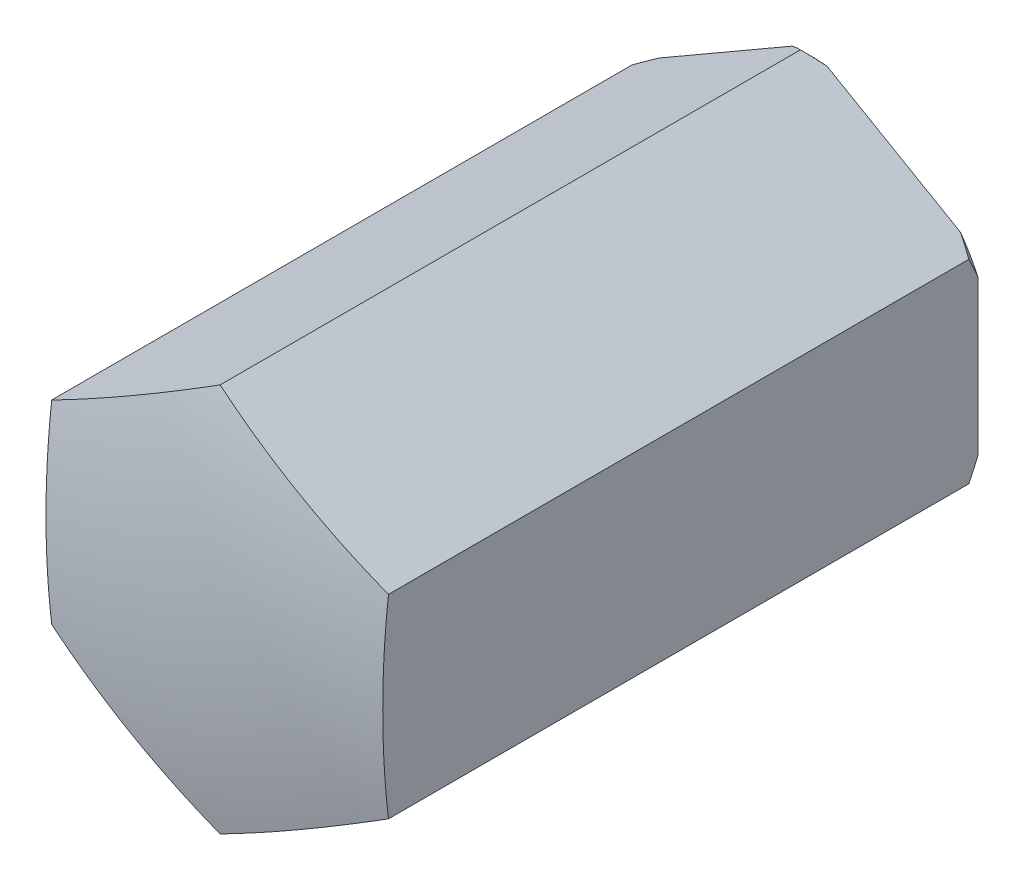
ISO-10303-21;
HEADER;
FILE_DESCRIPTION(('STEP AP214'),'2;1');
FILE_NAME('part.step','',(''),(''),'','','');
FILE_SCHEMA(('AUTOMOTIVE_DESIGN { 1 0 10303 214 1 1 1 1 }'));
ENDSEC;
DATA;
#1=APPLICATION_CONTEXT('core data for automotive mechanical design processes');
#2=APPLICATION_PROTOCOL_DEFINITION('international standard','automotive_design',2000,#1);
#3=PRODUCT_CONTEXT('',#1,'mechanical');
#4=PRODUCT('Part','Part','',(#3));
#5=PRODUCT_RELATED_PRODUCT_CATEGORY('part','',(#4));
#6=PRODUCT_DEFINITION_FORMATION('','',#4);
#7=PRODUCT_DEFINITION_CONTEXT('part definition',#1,'design');
#8=PRODUCT_DEFINITION('design','',#6,#7);
#9=PRODUCT_DEFINITION_SHAPE('','',#8);
#10=(LENGTH_UNIT() NAMED_UNIT(*) SI_UNIT(.MILLI.,.METRE.));
#11=(NAMED_UNIT(*) PLANE_ANGLE_UNIT() SI_UNIT($,.RADIAN.));
#12=(NAMED_UNIT(*) SI_UNIT($,.STERADIAN.) SOLID_ANGLE_UNIT());
#13=UNCERTAINTY_MEASURE_WITH_UNIT(LENGTH_MEASURE(1.E-05),#10,'distance_accuracy_value','');
#14=(GEOMETRIC_REPRESENTATION_CONTEXT(3) GLOBAL_UNCERTAINTY_ASSIGNED_CONTEXT((#13)) GLOBAL_UNIT_ASSIGNED_CONTEXT((#10,
#11,#12)) REPRESENTATION_CONTEXT('',''));
#15=CARTESIAN_POINT('',(0.,0.,0.));
#16=DIRECTION('',(0.,0.,1.));
#17=DIRECTION('',(1.,0.,0.));
#18=AXIS2_PLACEMENT_3D('',#15,#16,#17);
#19=CARTESIAN_POINT('',(0.,12.701705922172,41.));
#20=DIRECTION('',(0.500000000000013,-0.866025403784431,0.));
#21=DIRECTION('',(0.866025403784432,0.500000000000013,0.));
#22=AXIS2_PLACEMENT_3D('',#19,#20,#21);
#23=PLANE('',#22);
#24=CARTESIAN_POINT('',(-5.5000000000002,9.52627944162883,-15.));
#25=DIRECTION('',(0.500000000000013,-0.866025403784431,0.));
#26=DIRECTION('',(0.866025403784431,0.500000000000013,0.));
#27=AXIS2_PLACEMENT_3D('',#24,#25,#26);
#28=CIRCLE('',#27,53.8887743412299);
#29=CARTESIAN_POINT('',(0.,12.701705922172,38.5132382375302));
#30=VERTEX_POINT('',#29);
#31=CARTESIAN_POINT('',(-11.,6.3508529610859,38.5132382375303));
#32=VERTEX_POINT('',#31);
#33=EDGE_CURVE('E105',#30,#32,#28,.T.);
#34=ORIENTED_EDGE('',*,*,#33,.F.);
#35=DIRECTION('',(0.,0.,-1.));
#36=VECTOR('',#35,1.);
#37=CARTESIAN_POINT('',(0.,12.701705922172,41.));
#38=LINE('',#37,#36);
#39=CARTESIAN_POINT('',(0.,12.701705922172,0.601705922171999));
#40=VERTEX_POINT('',#39);
#41=EDGE_CURVE('E111',#30,#40,#38,.T.);
#42=ORIENTED_EDGE('',*,*,#41,.T.);
#43=CARTESIAN_POINT('',(0.000200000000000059,12.7018213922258,0.601821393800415));
#44=CARTESIAN_POINT('',(-0.0929349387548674,12.6480499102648,0.548049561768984));
#45=CARTESIAN_POINT('',(-0.186425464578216,12.594073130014,0.495094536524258));
#46=CARTESIAN_POINT('',(-0.374109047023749,12.4857139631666,0.390955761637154));
#47=CARTESIAN_POINT('',(-0.468301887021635,12.431331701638,0.339771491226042));
#48=CARTESIAN_POINT('',(-0.6574388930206,12.3221334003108,0.239278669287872));
#49=CARTESIAN_POINT('',(-0.752383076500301,12.2673173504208,0.189970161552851));
#50=CARTESIAN_POINT('',(-0.943063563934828,12.1572279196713,0.0933496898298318));
#51=CARTESIAN_POINT('',(-1.0388000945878,12.1019544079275,0.0460383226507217));
#52=CARTESIAN_POINT('',(-1.13492611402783,12.0464560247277,-0.000199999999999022));
#53=B_SPLINE_CURVE_WITH_KNOTS('',3,(#43,#44,#45,#46,#47,#48,#49,#50,#51,#52),.UNSPECIFIED.,.F.,
.F.,(4,2,2,2,4),(0.,0.360709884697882,0.721312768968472,1.08192406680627,1.44264237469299),.UNSPECIFIED.);
#54=CARTESIAN_POINT('',(-1.13451033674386,12.0466960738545,0.));
#55=VERTEX_POINT('',#54);
#56=EDGE_CURVE('E217',#40,#55,#53,.T.);
#57=ORIENTED_EDGE('',*,*,#56,.T.);
#58=DIRECTION('',(-0.866025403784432,-0.500000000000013,0.));
#59=VECTOR('',#58,1.);
#60=CARTESIAN_POINT('',(3.57499999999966,14.7657331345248,0.));
#61=LINE('',#60,#59);
#62=CARTESIAN_POINT('',(-9.86548966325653,7.00586280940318,0.));
#63=VERTEX_POINT('',#62);
#64=EDGE_CURVE('E23',#55,#63,#61,.T.);
#65=ORIENTED_EDGE('',*,*,#64,.T.);
#66=CARTESIAN_POINT('',(-9.86507388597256,7.00610285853,-0.00019999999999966));
#67=CARTESIAN_POINT('',(-9.96119990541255,6.95060447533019,0.0460383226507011));
#68=CARTESIAN_POINT('',(-10.0569364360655,6.89533096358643,0.0933496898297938));
#69=CARTESIAN_POINT('',(-10.2476169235,6.78524153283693,0.189970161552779));
#70=CARTESIAN_POINT('',(-10.3425611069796,6.73042548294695,0.239278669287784));
#71=CARTESIAN_POINT('',(-10.5316981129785,6.62122718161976,0.339771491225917));
#72=CARTESIAN_POINT('',(-10.6258909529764,6.56684492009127,0.390955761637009));
#73=CARTESIAN_POINT('',(-10.8135745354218,6.4584857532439,0.495094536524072));
#74=CARTESIAN_POINT('',(-10.9070650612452,6.40450897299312,0.548049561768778));
#75=CARTESIAN_POINT('',(-11.0002,6.35073749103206,0.601821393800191));
#76=B_SPLINE_CURVE_WITH_KNOTS('',3,(#66,#67,#68,#69,#70,#71,#72,#73,#74,#75),.UNSPECIFIED.,.F.,
.F.,(4,2,2,2,4),(0.,0.360718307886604,0.721329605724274,1.08193248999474,1.4426423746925),.UNSPECIFIED.);
#77=CARTESIAN_POINT('',(-11.,6.3508529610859,0.601705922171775));
#78=VERTEX_POINT('',#77);
#79=EDGE_CURVE('E223',#63,#78,#76,.T.);
#80=ORIENTED_EDGE('',*,*,#79,.T.);
#81=DIRECTION('',(0.,0.,-1.));
#82=VECTOR('',#81,1.);
#83=CARTESIAN_POINT('',(-11.,6.3508529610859,41.));
#84=LINE('',#83,#82);
#85=EDGE_CURVE('E114',#32,#78,#84,.T.);
#86=ORIENTED_EDGE('',*,*,#85,.F.);
#87=EDGE_LOOP('',(#34,#42,#57,#65,#80,#86));
#88=FACE_BOUND('',#87,.T.);
#89=ADVANCED_FACE('F14',(#88),#23,.F.);
#90=CARTESIAN_POINT('',(-11.,6.3508529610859,41.));
#91=DIRECTION('',(1.,0.,0.));
#92=DIRECTION('',(0.,1.,0.));
#93=AXIS2_PLACEMENT_3D('',#90,#91,#92);
#94=PLANE('',#93);
#95=CARTESIAN_POINT('',(-11.,0.,-15.));
#96=DIRECTION('',(1.,0.,0.));
#97=DIRECTION('',(0.,0.,-1.));
#98=AXIS2_PLACEMENT_3D('',#95,#96,#97);
#99=CIRCLE('',#98,53.8887743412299);
#100=CARTESIAN_POINT('',(-11.,-6.3508529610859,38.5132382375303));
#101=VERTEX_POINT('',#100);
#102=EDGE_CURVE('E116',#32,#101,#99,.T.);
#103=ORIENTED_EDGE('',*,*,#102,.F.);
#104=ORIENTED_EDGE('',*,*,#85,.T.);
#105=CARTESIAN_POINT('',(-11.,16.0724477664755,7.37623108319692));
#106=CARTESIAN_POINT('',(-11.,15.8702057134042,7.2093371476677));
#107=CARTESIAN_POINT('',(-11.,15.6674737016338,7.04303709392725));
#108=CARTESIAN_POINT('',(-11.,15.2609313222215,6.71175492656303));
#109=CARTESIAN_POINT('',(-11.,15.0571209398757,6.54677283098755));
#110=CARTESIAN_POINT('',(-11.,14.4438351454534,6.05392702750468));
#111=CARTESIAN_POINT('',(-11.,14.0326017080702,5.72824373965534));
#112=CARTESIAN_POINT('',(-11.,13.1999564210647,5.08050106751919));
#113=CARTESIAN_POINT('',(-11.,12.7784823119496,4.75852150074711));
#114=CARTESIAN_POINT('',(-11.,11.9286566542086,4.12384110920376));
#115=CARTESIAN_POINT('',(-11.,11.5003057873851,3.81113937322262));
#116=CARTESIAN_POINT('',(-11.,10.5931500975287,3.16769731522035));
#117=CARTESIAN_POINT('',(-11.,10.1134868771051,2.83815635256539));
#118=CARTESIAN_POINT('',(-11.,9.38449294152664,2.35805816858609));
#119=CARTESIAN_POINT('',(-11.,9.13985858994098,2.20036220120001));
#120=CARTESIAN_POINT('',(-11.,8.64708986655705,1.89054685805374));
#121=CARTESIAN_POINT('',(-11.,8.39895566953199,1.73842720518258));
#122=CARTESIAN_POINT('',(-11.,7.89995903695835,1.441394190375));
#123=CARTESIAN_POINT('',(-11.,7.64911460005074,1.29645066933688));
#124=CARTESIAN_POINT('',(-11.,7.14316420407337,1.01414178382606));
#125=CARTESIAN_POINT('',(-11.,6.8880580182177,0.876776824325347));
#126=CARTESIAN_POINT('',(-11.,6.37340355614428,0.611087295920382));
#127=CARTESIAN_POINT('',(-11.,6.11385871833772,0.482756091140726));
#128=CARTESIAN_POINT('',(-11.,5.58983912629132,0.236644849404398));
#129=CARTESIAN_POINT('',(-11.,5.32536528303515,0.118862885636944));
#130=CARTESIAN_POINT('',(-11.,4.87055760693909,-0.0711489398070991));
#131=CARTESIAN_POINT('',(-11.,4.68153595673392,-0.146517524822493));
#132=CARTESIAN_POINT('',(-11.,4.30090682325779,-0.290396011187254));
#133=CARTESIAN_POINT('',(-11.,4.10929935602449,-0.35890595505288));
#134=CARTESIAN_POINT('',(-11.,3.53054922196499,-0.55302199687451));
#135=CARTESIAN_POINT('',(-11.,3.13947003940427,-0.667218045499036));
#136=CARTESIAN_POINT('',(-11.,2.3571577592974,-0.856520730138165));
#137=CARTESIAN_POINT('',(-11.,1.96613010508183,-0.932456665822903));
#138=CARTESIAN_POINT('',(-11.,1.3754168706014,-1.01606525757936));
#139=CARTESIAN_POINT('',(-11.,1.17780635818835,-1.03888598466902));
#140=CARTESIAN_POINT('',(-11.,0.781637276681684,-1.0740268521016));
#141=CARTESIAN_POINT('',(-11.,0.583078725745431,-1.0863471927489));
#142=CARTESIAN_POINT('',(-11.,0.196510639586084,-1.09984708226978));
#143=CARTESIAN_POINT('',(-11.,0.00852086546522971,-1.10160151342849));
#144=CARTESIAN_POINT('',(-11.,-0.367323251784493,-1.09547279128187));
#145=CARTESIAN_POINT('',(-11.,-0.555177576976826,-1.08758853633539));
#146=CARTESIAN_POINT('',(-11.,-0.930229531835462,-1.06232225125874));
#147=CARTESIAN_POINT('',(-11.,-1.11742721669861,-1.04494103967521));
#148=CARTESIAN_POINT('',(-11.,-1.49075054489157,-1.00099406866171));
#149=CARTESIAN_POINT('',(-11.,-1.67687603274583,-0.974427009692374));
#150=CARTESIAN_POINT('',(-11.,-2.24018324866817,-0.880381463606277));
#151=CARTESIAN_POINT('',(-11.,-2.61511811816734,-0.799063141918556));
#152=CARTESIAN_POINT('',(-11.,-3.35650285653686,-0.604878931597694));
#153=CARTESIAN_POINT('',(-11.,-3.72295280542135,-0.492013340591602));
#154=CARTESIAN_POINT('',(-11.,-4.4529629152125,-0.237887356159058));
#155=CARTESIAN_POINT('',(-11.,-4.81636046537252,-0.0961649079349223));
#156=CARTESIAN_POINT('',(-11.,-5.53386860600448,0.20927334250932));
#157=CARTESIAN_POINT('',(-11.,-5.88797506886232,0.372998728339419));
#158=CARTESIAN_POINT('',(-11.,-6.5885282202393,0.718563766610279));
#159=CARTESIAN_POINT('',(-11.,-6.93494780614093,0.900457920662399));
#160=CARTESIAN_POINT('',(-11.,-7.61987412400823,1.27837528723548));
#161=CARTESIAN_POINT('',(-11.,-7.95838202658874,1.47439639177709));
#162=CARTESIAN_POINT('',(-11.,-8.61194162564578,1.86785203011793));
#163=CARTESIAN_POINT('',(-11.,-8.92732558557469,2.06473756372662));
#164=CARTESIAN_POINT('',(-11.,-9.55267412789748,2.46695903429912));
#165=CARTESIAN_POINT('',(-11.,-9.86263830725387,2.67229559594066));
#166=CARTESIAN_POINT('',(-11.,-10.4753887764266,3.08826754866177));
#167=CARTESIAN_POINT('',(-11.,-10.7782124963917,3.29884800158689));
#168=CARTESIAN_POINT('',(-11.,-11.3796956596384,3.72570793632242));
#169=CARTESIAN_POINT('',(-11.,-11.6783562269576,3.94198583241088));
#170=CARTESIAN_POINT('',(-11.,-11.9752680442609,4.16059792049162));
#171=B_SPLINE_CURVE_WITH_KNOTS('',3,(#105,#106,#107,#108,#109,#110,#111,#112,#113,#114,#115,
#116,#117,#118,#119,#120,#121,#122,#123,#124,#125,#126,#127,#128,#129,#130,#131,#132,#133,#134,
#135,#136,#137,#138,#139,#140,#141,#142,#143,#144,#145,#146,#147,#148,#149,#150,#151,#152,#153,
#154,#155,#156,#157,#158,#159,#160,#161,#162,#163,#164,#165,#166,#167,#168,#169,#170),
.UNSPECIFIED.,.F.,.F.,(4,2,2,2,2,2,2,2,2,2,2,2,2,2,2,2,2,2,2,2,2,2,2,2,2,2,2,2,2,2,2,2,4),(0.,
0.7866358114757,1.57328237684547,3.14695168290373,4.73801099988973,6.32891353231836,
8.0743905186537,8.94750152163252,9.82056907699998,10.6895860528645,11.5586494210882,
12.4270675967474,13.2953268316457,13.9056838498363,14.5160370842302,15.7367149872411,
16.9296541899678,17.5261883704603,18.1227111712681,18.6864613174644,19.2502759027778,
19.8140419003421,20.3778876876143,21.5270730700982,22.6762476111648,23.845519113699,
25.0153015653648,26.1887049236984,27.3619335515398,28.4771587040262,29.5924664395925,
30.698929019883,31.8050868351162),.UNSPECIFIED.);
#172=CARTESIAN_POINT('',(-11.,5.04083326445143,0.));
#173=VERTEX_POINT('',#172);
#174=EDGE_CURVE('E216',#78,#173,#171,.T.);
#175=ORIENTED_EDGE('',*,*,#174,.T.);
#176=DIRECTION('',(0.,-1.,0.));
#177=VECTOR('',#176,1.);
#178=CARTESIAN_POINT('',(-11.,0.,0.));
#179=LINE('',#178,#177);
#180=CARTESIAN_POINT('',(-11.,-5.04083326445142,0.));
#181=VERTEX_POINT('',#180);
#182=EDGE_CURVE('E242',#173,#181,#179,.T.);
#183=ORIENTED_EDGE('',*,*,#182,.T.);
#184=CARTESIAN_POINT('',(-11.,-6.3508529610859,0.601705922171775));
#185=VERTEX_POINT('',#184);
#186=EDGE_CURVE('E209',#181,#185,#171,.T.);
#187=ORIENTED_EDGE('',*,*,#186,.T.);
#188=DIRECTION('',(0.,0.,-1.));
#189=VECTOR('',#188,1.);
#190=CARTESIAN_POINT('',(-11.,-6.3508529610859,41.));
#191=LINE('',#190,#189);
#192=EDGE_CURVE('E134',#101,#185,#191,.T.);
#193=ORIENTED_EDGE('',*,*,#192,.F.);
#194=EDGE_LOOP('',(#103,#104,#175,#183,#187,#193));
#195=FACE_BOUND('',#194,.T.);
#196=ADVANCED_FACE('F201',(#195),#94,.F.);
#197=CARTESIAN_POINT('',(-11.,-6.3508529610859,41.));
#198=DIRECTION('',(0.500000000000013,0.866025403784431,0.));
#199=DIRECTION('',(-0.866025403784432,0.500000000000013,0.));
#200=AXIS2_PLACEMENT_3D('',#197,#198,#199);
#201=PLANE('',#200);
#202=CARTESIAN_POINT('',(-5.5000000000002,-9.52627944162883,-15.));
#203=DIRECTION('',(0.500000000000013,0.866025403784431,0.));
#204=DIRECTION('',(-0.866025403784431,0.500000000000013,0.));
#205=AXIS2_PLACEMENT_3D('',#202,#203,#204);
#206=CIRCLE('',#205,53.8887743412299);
#207=CARTESIAN_POINT('',(0.,-12.701705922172,38.5132382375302));
#208=VERTEX_POINT('',#207);
#209=EDGE_CURVE('E289',#101,#208,#206,.T.);
#210=ORIENTED_EDGE('',*,*,#209,.F.);
#211=ORIENTED_EDGE('',*,*,#192,.T.);
#212=CARTESIAN_POINT('',(-11.0002,-6.35073749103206,0.601821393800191));
#213=CARTESIAN_POINT('',(-10.9070650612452,-6.40450897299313,0.548049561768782));
#214=CARTESIAN_POINT('',(-10.8135745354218,-6.4584857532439,0.495094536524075));
#215=CARTESIAN_POINT('',(-10.6258909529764,-6.56684492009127,0.390955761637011));
#216=CARTESIAN_POINT('',(-10.5316981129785,-6.62122718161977,0.339771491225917));
#217=CARTESIAN_POINT('',(-10.3425611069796,-6.73042548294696,0.239278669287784));
#218=CARTESIAN_POINT('',(-10.2476169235,-6.78524153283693,0.189970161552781));
#219=CARTESIAN_POINT('',(-10.0569364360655,-6.89533096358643,0.0933496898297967));
#220=CARTESIAN_POINT('',(-9.96119990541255,-6.95060447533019,0.0460383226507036));
#221=CARTESIAN_POINT('',(-9.86507388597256,-7.00610285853,-0.000200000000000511));
#222=B_SPLINE_CURVE_WITH_KNOTS('',3,(#212,#213,#214,#215,#216,#217,#218,#219,#220,#221),
.UNSPECIFIED.,.F.,.F.,(4,2,2,2,4),(0.,0.360709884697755,0.721312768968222,1.08192406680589,
1.4426423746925),.UNSPECIFIED.);
#223=CARTESIAN_POINT('',(-9.86548966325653,-7.00586280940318,0.));
#224=VERTEX_POINT('',#223);
#225=EDGE_CURVE('E185',#185,#224,#222,.T.);
#226=ORIENTED_EDGE('',*,*,#225,.T.);
#227=DIRECTION('',(0.866025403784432,-0.500000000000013,0.));
#228=VECTOR('',#227,1.);
#229=CARTESIAN_POINT('',(3.57499999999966,-14.7657331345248,0.));
#230=LINE('',#229,#228);
#231=CARTESIAN_POINT('',(-1.13451033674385,-12.0466960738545,0.));
#232=VERTEX_POINT('',#231);
#233=EDGE_CURVE('E240',#224,#232,#230,.T.);
#234=ORIENTED_EDGE('',*,*,#233,.T.);
#235=CARTESIAN_POINT('',(-1.13492611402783,-12.0464560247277,-0.00019999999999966));
#236=CARTESIAN_POINT('',(-1.0388000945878,-12.1019544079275,0.0460383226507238));
#237=CARTESIAN_POINT('',(-0.94306356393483,-12.1572279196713,0.0933496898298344));
#238=CARTESIAN_POINT('',(-0.752383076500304,-12.2673173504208,0.189970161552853));
#239=CARTESIAN_POINT('',(-0.657438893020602,-12.3221334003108,0.239278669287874));
#240=CARTESIAN_POINT('',(-0.468301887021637,-12.431331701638,0.339771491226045));
#241=CARTESIAN_POINT('',(-0.374109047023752,-12.4857139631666,0.390955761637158));
#242=CARTESIAN_POINT('',(-0.186425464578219,-12.594073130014,0.495094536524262));
#243=CARTESIAN_POINT('',(-0.0929349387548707,-12.6480499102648,0.548049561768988));
#244=CARTESIAN_POINT('',(0.000199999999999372,-12.7018213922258,0.601821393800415));
#245=B_SPLINE_CURVE_WITH_KNOTS('',3,(#235,#236,#237,#238,#239,#240,#241,#242,#243,#244),
.UNSPECIFIED.,.F.,.F.,(4,2,2,2,4),(0.,0.360718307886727,0.721329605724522,1.08193248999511,
1.44264237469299),.UNSPECIFIED.);
#246=CARTESIAN_POINT('',(0.,-12.701705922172,0.601705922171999));
#247=VERTEX_POINT('',#246);
#248=EDGE_CURVE('E191',#232,#247,#245,.T.);
#249=ORIENTED_EDGE('',*,*,#248,.T.);
#250=DIRECTION('',(0.,0.,-1.));
#251=VECTOR('',#250,1.);
#252=CARTESIAN_POINT('',(0.,-12.701705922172,41.));
#253=LINE('',#252,#251);
#254=EDGE_CURVE('E132',#208,#247,#253,.T.);
#255=ORIENTED_EDGE('',*,*,#254,.F.);
#256=EDGE_LOOP('',(#210,#211,#226,#234,#249,#255));
#257=FACE_BOUND('',#256,.T.);
#258=ADVANCED_FACE('F197',(#257),#201,.F.);
#259=CARTESIAN_POINT('',(0.,-12.701705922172,41.));
#260=DIRECTION('',(-0.500000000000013,0.866025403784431,0.));
#261=DIRECTION('',(-0.866025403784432,-0.500000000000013,0.));
#262=AXIS2_PLACEMENT_3D('',#259,#260,#261);
#263=PLANE('',#262);
#264=CARTESIAN_POINT('',(5.5000000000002,-9.52627944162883,-15.));
#265=DIRECTION('',(-0.500000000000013,0.866025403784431,0.));
#266=DIRECTION('',(-0.866025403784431,-0.500000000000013,0.));
#267=AXIS2_PLACEMENT_3D('',#264,#265,#266);
#268=CIRCLE('',#267,53.8887743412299);
#269=CARTESIAN_POINT('',(11.,-6.3508529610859,38.5132382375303));
#270=VERTEX_POINT('',#269);
#271=EDGE_CURVE('E291',#208,#270,#268,.T.);
#272=ORIENTED_EDGE('',*,*,#271,.F.);
#273=ORIENTED_EDGE('',*,*,#254,.T.);
#274=CARTESIAN_POINT('',(-0.000200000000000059,-12.7018213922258,0.601821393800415));
#275=CARTESIAN_POINT('',(0.0929349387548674,-12.6480499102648,0.548049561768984));
#276=CARTESIAN_POINT('',(0.186425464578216,-12.594073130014,0.495094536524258));
#277=CARTESIAN_POINT('',(0.374109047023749,-12.4857139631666,0.390955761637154));
#278=CARTESIAN_POINT('',(0.468301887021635,-12.431331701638,0.339771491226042));
#279=CARTESIAN_POINT('',(0.6574388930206,-12.3221334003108,0.239278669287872));
#280=CARTESIAN_POINT('',(0.752383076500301,-12.2673173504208,0.189970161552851));
#281=CARTESIAN_POINT('',(0.943063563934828,-12.1572279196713,0.0933496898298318));
#282=CARTESIAN_POINT('',(1.0388000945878,-12.1019544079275,0.0460383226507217));
#283=CARTESIAN_POINT('',(1.13492611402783,-12.0464560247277,-0.000199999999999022));
#284=B_SPLINE_CURVE_WITH_KNOTS('',3,(#274,#275,#276,#277,#278,#279,#280,#281,#282,#283),
.UNSPECIFIED.,.F.,.F.,(4,2,2,2,4),(0.,0.360709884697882,0.721312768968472,1.08192406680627,
1.44264237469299),.UNSPECIFIED.);
#285=CARTESIAN_POINT('',(1.13451033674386,-12.0466960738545,0.));
#286=VERTEX_POINT('',#285);
#287=EDGE_CURVE('E172',#247,#286,#284,.T.);
#288=ORIENTED_EDGE('',*,*,#287,.T.);
#289=DIRECTION('',(0.866025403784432,0.500000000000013,0.));
#290=VECTOR('',#289,1.);
#291=CARTESIAN_POINT('',(14.575,-4.28682574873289,0.));
#292=LINE('',#291,#290);
#293=CARTESIAN_POINT('',(9.86548966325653,-7.00586280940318,0.));
#294=VERTEX_POINT('',#293);
#295=EDGE_CURVE('E238',#286,#294,#292,.T.);
#296=ORIENTED_EDGE('',*,*,#295,.T.);
#297=CARTESIAN_POINT('',(9.86507388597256,-7.00610285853,-0.00019999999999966));
#298=CARTESIAN_POINT('',(9.96119990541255,-6.95060447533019,0.0460383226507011));
#299=CARTESIAN_POINT('',(10.0569364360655,-6.89533096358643,0.0933496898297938));
#300=CARTESIAN_POINT('',(10.2476169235,-6.78524153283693,0.189970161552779));
#301=CARTESIAN_POINT('',(10.3425611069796,-6.73042548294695,0.239278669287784));
#302=CARTESIAN_POINT('',(10.5316981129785,-6.62122718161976,0.339771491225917));
#303=CARTESIAN_POINT('',(10.6258909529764,-6.56684492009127,0.390955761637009));
#304=CARTESIAN_POINT('',(10.8135745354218,-6.4584857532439,0.495094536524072));
#305=CARTESIAN_POINT('',(10.9070650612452,-6.40450897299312,0.548049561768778));
#306=CARTESIAN_POINT('',(11.0002,-6.35073749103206,0.601821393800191));
#307=B_SPLINE_CURVE_WITH_KNOTS('',3,(#297,#298,#299,#300,#301,#302,#303,#304,#305,#306),
.UNSPECIFIED.,.F.,.F.,(4,2,2,2,4),(0.,0.360718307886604,0.721329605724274,1.08193248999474,
1.4426423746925),.UNSPECIFIED.);
#308=CARTESIAN_POINT('',(11.,-6.3508529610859,0.601705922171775));
#309=VERTEX_POINT('',#308);
#310=EDGE_CURVE('E178',#294,#309,#307,.T.);
#311=ORIENTED_EDGE('',*,*,#310,.T.);
#312=DIRECTION('',(0.,0.,-1.));
#313=VECTOR('',#312,1.);
#314=CARTESIAN_POINT('',(11.,-6.3508529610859,41.));
#315=LINE('',#314,#313);
#316=EDGE_CURVE('E125',#270,#309,#315,.T.);
#317=ORIENTED_EDGE('',*,*,#316,.F.);
#318=EDGE_LOOP('',(#272,#273,#288,#296,#311,#317));
#319=FACE_BOUND('',#318,.T.);
#320=ADVANCED_FACE('F160',(#319),#263,.F.);
#321=CARTESIAN_POINT('',(11.,-6.3508529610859,41.));
#322=DIRECTION('',(-1.,0.,0.));
#323=DIRECTION('',(0.,-1.,0.));
#324=AXIS2_PLACEMENT_3D('',#321,#322,#323);
#325=PLANE('',#324);
#326=CARTESIAN_POINT('',(11.,0.,-15.));
#327=DIRECTION('',(-1.,0.,0.));
#328=DIRECTION('',(0.,0.,1.));
#329=AXIS2_PLACEMENT_3D('',#326,#327,#328);
#330=CIRCLE('',#329,53.8887743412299);
#331=CARTESIAN_POINT('',(11.,6.3508529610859,38.5132382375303));
#332=VERTEX_POINT('',#331);
#333=EDGE_CURVE('E29',#270,#332,#330,.T.);
#334=ORIENTED_EDGE('',*,*,#333,.F.);
#335=ORIENTED_EDGE('',*,*,#316,.T.);
#336=CARTESIAN_POINT('',(11.,16.0724477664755,7.37623108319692));
#337=CARTESIAN_POINT('',(11.,15.8702057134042,7.2093371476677));
#338=CARTESIAN_POINT('',(11.,15.6674737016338,7.04303709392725));
#339=CARTESIAN_POINT('',(11.,15.2609313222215,6.71175492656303));
#340=CARTESIAN_POINT('',(11.,15.0571209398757,6.54677283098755));
#341=CARTESIAN_POINT('',(11.,14.4438351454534,6.05392702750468));
#342=CARTESIAN_POINT('',(11.,14.0326017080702,5.72824373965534));
#343=CARTESIAN_POINT('',(11.,13.1999564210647,5.08050106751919));
#344=CARTESIAN_POINT('',(11.,12.7784823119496,4.75852150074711));
#345=CARTESIAN_POINT('',(11.,11.9286566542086,4.12384110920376));
#346=CARTESIAN_POINT('',(11.,11.5003057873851,3.81113937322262));
#347=CARTESIAN_POINT('',(11.,10.5931500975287,3.16769731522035));
#348=CARTESIAN_POINT('',(11.,10.1134868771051,2.83815635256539));
#349=CARTESIAN_POINT('',(11.,9.38449294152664,2.35805816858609));
#350=CARTESIAN_POINT('',(11.,9.13985858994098,2.20036220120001));
#351=CARTESIAN_POINT('',(11.,8.64708986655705,1.89054685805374));
#352=CARTESIAN_POINT('',(11.,8.39895566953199,1.73842720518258));
#353=CARTESIAN_POINT('',(11.,7.89995903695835,1.441394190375));
#354=CARTESIAN_POINT('',(11.,7.64911460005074,1.29645066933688));
#355=CARTESIAN_POINT('',(11.,7.14316420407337,1.01414178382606));
#356=CARTESIAN_POINT('',(11.,6.8880580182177,0.876776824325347));
#357=CARTESIAN_POINT('',(11.,6.37340355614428,0.611087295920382));
#358=CARTESIAN_POINT('',(11.,6.11385871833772,0.482756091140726));
#359=CARTESIAN_POINT('',(11.,5.58983912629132,0.236644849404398));
#360=CARTESIAN_POINT('',(11.,5.32536528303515,0.118862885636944));
#361=CARTESIAN_POINT('',(11.,4.87055760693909,-0.0711489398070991));
#362=CARTESIAN_POINT('',(11.,4.68153595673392,-0.146517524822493));
#363=CARTESIAN_POINT('',(11.,4.30090682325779,-0.290396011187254));
#364=CARTESIAN_POINT('',(11.,4.10929935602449,-0.35890595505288));
#365=CARTESIAN_POINT('',(11.,3.53054922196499,-0.55302199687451));
#366=CARTESIAN_POINT('',(11.,3.13947003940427,-0.667218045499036));
#367=CARTESIAN_POINT('',(11.,2.3571577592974,-0.856520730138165));
#368=CARTESIAN_POINT('',(11.,1.96613010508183,-0.932456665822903));
#369=CARTESIAN_POINT('',(11.,1.3754168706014,-1.01606525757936));
#370=CARTESIAN_POINT('',(11.,1.17780635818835,-1.03888598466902));
#371=CARTESIAN_POINT('',(11.,0.781637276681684,-1.0740268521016));
#372=CARTESIAN_POINT('',(11.,0.583078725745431,-1.0863471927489));
#373=CARTESIAN_POINT('',(11.,0.196510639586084,-1.09984708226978));
#374=CARTESIAN_POINT('',(11.,0.00852086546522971,-1.10160151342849));
#375=CARTESIAN_POINT('',(11.,-0.367323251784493,-1.09547279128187));
#376=CARTESIAN_POINT('',(11.,-0.555177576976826,-1.08758853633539));
#377=CARTESIAN_POINT('',(11.,-0.930229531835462,-1.06232225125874));
#378=CARTESIAN_POINT('',(11.,-1.11742721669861,-1.04494103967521));
#379=CARTESIAN_POINT('',(11.,-1.49075054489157,-1.00099406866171));
#380=CARTESIAN_POINT('',(11.,-1.67687603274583,-0.974427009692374));
#381=CARTESIAN_POINT('',(11.,-2.24018324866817,-0.880381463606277));
#382=CARTESIAN_POINT('',(11.,-2.61511811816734,-0.799063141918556));
#383=CARTESIAN_POINT('',(11.,-3.35650285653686,-0.604878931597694));
#384=CARTESIAN_POINT('',(11.,-3.72295280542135,-0.492013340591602));
#385=CARTESIAN_POINT('',(11.,-4.4529629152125,-0.237887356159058));
#386=CARTESIAN_POINT('',(11.,-4.81636046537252,-0.0961649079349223));
#387=CARTESIAN_POINT('',(11.,-5.53386860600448,0.20927334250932));
#388=CARTESIAN_POINT('',(11.,-5.88797506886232,0.372998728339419));
#389=CARTESIAN_POINT('',(11.,-6.5885282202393,0.718563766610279));
#390=CARTESIAN_POINT('',(11.,-6.93494780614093,0.900457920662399));
#391=CARTESIAN_POINT('',(11.,-7.61987412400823,1.27837528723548));
#392=CARTESIAN_POINT('',(11.,-7.95838202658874,1.47439639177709));
#393=CARTESIAN_POINT('',(11.,-8.61194162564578,1.86785203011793));
#394=CARTESIAN_POINT('',(11.,-8.92732558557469,2.06473756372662));
#395=CARTESIAN_POINT('',(11.,-9.55267412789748,2.46695903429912));
#396=CARTESIAN_POINT('',(11.,-9.86263830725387,2.67229559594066));
#397=CARTESIAN_POINT('',(11.,-10.4753887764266,3.08826754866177));
#398=CARTESIAN_POINT('',(11.,-10.7782124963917,3.29884800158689));
#399=CARTESIAN_POINT('',(11.,-11.3796956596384,3.72570793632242));
#400=CARTESIAN_POINT('',(11.,-11.6783562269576,3.94198583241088));
#401=CARTESIAN_POINT('',(11.,-11.9752680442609,4.16059792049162));
#402=B_SPLINE_CURVE_WITH_KNOTS('',3,(#336,#337,#338,#339,#340,#341,#342,#343,#344,#345,#346,
#347,#348,#349,#350,#351,#352,#353,#354,#355,#356,#357,#358,#359,#360,#361,#362,#363,#364,#365,
#366,#367,#368,#369,#370,#371,#372,#373,#374,#375,#376,#377,#378,#379,#380,#381,#382,#383,#384,
#385,#386,#387,#388,#389,#390,#391,#392,#393,#394,#395,#396,#397,#398,#399,#400,#401),
.UNSPECIFIED.,.F.,.F.,(4,2,2,2,2,2,2,2,2,2,2,2,2,2,2,2,2,2,2,2,2,2,2,2,2,2,2,2,2,2,2,2,4),(0.,
0.7866358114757,1.57328237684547,3.14695168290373,4.73801099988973,6.32891353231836,
8.0743905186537,8.94750152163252,9.82056907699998,10.6895860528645,11.5586494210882,
12.4270675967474,13.2953268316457,13.9056838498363,14.5160370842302,15.7367149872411,
16.9296541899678,17.5261883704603,18.1227111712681,18.6864613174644,19.2502759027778,
19.8140419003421,20.3778876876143,21.5270730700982,22.6762476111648,23.845519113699,
25.0153015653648,26.1887049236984,27.3619335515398,28.4771587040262,29.5924664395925,
30.698929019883,31.8050868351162),.UNSPECIFIED.);
#403=CARTESIAN_POINT('',(11.,-5.04083326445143,0.));
#404=VERTEX_POINT('',#403);
#405=EDGE_CURVE('E171',#309,#404,#402,.F.);
#406=ORIENTED_EDGE('',*,*,#405,.T.);
#407=DIRECTION('',(0.,1.,0.));
#408=VECTOR('',#407,1.);
#409=CARTESIAN_POINT('',(11.,0.,0.));
#410=LINE('',#409,#408);
#411=CARTESIAN_POINT('',(11.,5.04083326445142,0.));
#412=VERTEX_POINT('',#411);
#413=EDGE_CURVE('E236',#404,#412,#410,.T.);
#414=ORIENTED_EDGE('',*,*,#413,.T.);
#415=CARTESIAN_POINT('',(11.,6.3508529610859,0.601705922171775));
#416=VERTEX_POINT('',#415);
#417=EDGE_CURVE('E164',#412,#416,#402,.F.);
#418=ORIENTED_EDGE('',*,*,#417,.T.);
#419=DIRECTION('',(0.,0.,-1.));
#420=VECTOR('',#419,1.);
#421=CARTESIAN_POINT('',(11.,6.3508529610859,41.));
#422=LINE('',#421,#420);
#423=EDGE_CURVE('E122',#332,#416,#422,.T.);
#424=ORIENTED_EDGE('',*,*,#423,.F.);
#425=EDGE_LOOP('',(#334,#335,#406,#414,#418,#424));
#426=FACE_BOUND('',#425,.T.);
#427=ADVANCED_FACE('F153',(#426),#325,.F.);
#428=CARTESIAN_POINT('',(11.,6.3508529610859,41.));
#429=DIRECTION('',(-0.500000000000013,-0.866025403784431,0.));
#430=DIRECTION('',(0.866025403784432,-0.500000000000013,0.));
#431=AXIS2_PLACEMENT_3D('',#428,#429,#430);
#432=PLANE('',#431);
#433=CARTESIAN_POINT('',(5.5000000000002,9.52627944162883,-15.));
#434=DIRECTION('',(-0.500000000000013,-0.866025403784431,0.));
#435=DIRECTION('',(0.866025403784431,-0.500000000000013,0.));
#436=AXIS2_PLACEMENT_3D('',#433,#434,#435);
#437=CIRCLE('',#436,53.8887743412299);
#438=EDGE_CURVE('E9',#332,#30,#437,.T.);
#439=ORIENTED_EDGE('',*,*,#438,.F.);
#440=ORIENTED_EDGE('',*,*,#423,.T.);
#441=CARTESIAN_POINT('',(11.0002,6.35073749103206,0.601821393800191));
#442=CARTESIAN_POINT('',(10.9070650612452,6.40450897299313,0.548049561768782));
#443=CARTESIAN_POINT('',(10.8135745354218,6.4584857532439,0.495094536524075));
#444=CARTESIAN_POINT('',(10.6258909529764,6.56684492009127,0.390955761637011));
#445=CARTESIAN_POINT('',(10.5316981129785,6.62122718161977,0.339771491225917));
#446=CARTESIAN_POINT('',(10.3425611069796,6.73042548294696,0.239278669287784));
#447=CARTESIAN_POINT('',(10.2476169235,6.78524153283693,0.189970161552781));
#448=CARTESIAN_POINT('',(10.0569364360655,6.89533096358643,0.0933496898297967));
#449=CARTESIAN_POINT('',(9.96119990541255,6.95060447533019,0.0460383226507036));
#450=CARTESIAN_POINT('',(9.86507388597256,7.00610285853,-0.000200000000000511));
#451=B_SPLINE_CURVE_WITH_KNOTS('',3,(#441,#442,#443,#444,#445,#446,#447,#448,#449,#450),
.UNSPECIFIED.,.F.,.F.,(4,2,2,2,4),(0.,0.360709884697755,0.721312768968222,1.08192406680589,
1.4426423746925),.UNSPECIFIED.);
#452=CARTESIAN_POINT('',(9.86548966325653,7.00586280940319,0.));
#453=VERTEX_POINT('',#452);
#454=EDGE_CURVE('E37',#416,#453,#451,.T.);
#455=ORIENTED_EDGE('',*,*,#454,.T.);
#456=DIRECTION('',(-0.866025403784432,0.500000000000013,0.));
#457=VECTOR('',#456,1.);
#458=CARTESIAN_POINT('',(14.575,4.28682574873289,0.));
#459=LINE('',#458,#457);
#460=CARTESIAN_POINT('',(1.13451033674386,12.0466960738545,0.));
#461=VERTEX_POINT('',#460);
#462=EDGE_CURVE('E234',#453,#461,#459,.T.);
#463=ORIENTED_EDGE('',*,*,#462,.T.);
#464=CARTESIAN_POINT('',(1.13492611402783,12.0464560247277,-0.00019999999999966));
#465=CARTESIAN_POINT('',(1.0388000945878,12.1019544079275,0.0460383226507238));
#466=CARTESIAN_POINT('',(0.94306356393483,12.1572279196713,0.0933496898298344));
#467=CARTESIAN_POINT('',(0.752383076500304,12.2673173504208,0.189970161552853));
#468=CARTESIAN_POINT('',(0.657438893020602,12.3221334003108,0.239278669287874));
#469=CARTESIAN_POINT('',(0.468301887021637,12.431331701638,0.339771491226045));
#470=CARTESIAN_POINT('',(0.374109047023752,12.4857139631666,0.390955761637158));
#471=CARTESIAN_POINT('',(0.186425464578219,12.594073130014,0.495094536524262));
#472=CARTESIAN_POINT('',(0.0929349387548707,12.6480499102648,0.548049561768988));
#473=CARTESIAN_POINT('',(-0.000199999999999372,12.7018213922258,0.601821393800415));
#474=B_SPLINE_CURVE_WITH_KNOTS('',3,(#464,#465,#466,#467,#468,#469,#470,#471,#472,#473),
.UNSPECIFIED.,.F.,.F.,(4,2,2,2,4),(0.,0.360718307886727,0.721329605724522,1.08193248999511,
1.44264237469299),.UNSPECIFIED.);
#475=EDGE_CURVE('E120',#461,#40,#474,.T.);
#476=ORIENTED_EDGE('',*,*,#475,.T.);
#477=ORIENTED_EDGE('',*,*,#41,.F.);
#478=EDGE_LOOP('',(#439,#440,#455,#463,#476,#477));
#479=FACE_BOUND('',#478,.T.);
#480=ADVANCED_FACE('F118',(#479),#432,.F.);
#481=CARTESIAN_POINT('',(0.,0.,0.));
#482=DIRECTION('',(0.,0.,1.));
#483=DIRECTION('',(0.,-1.,0.));
#484=AXIS2_PLACEMENT_3D('',#481,#482,#483);
#485=CONICAL_SURFACE('',#484,12.1,0.785398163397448);
#486=ORIENTED_EDGE('',*,*,#79,.F.);
#487=CARTESIAN_POINT('',(0.,0.,0.));
#488=DIRECTION('',(0.,0.,-1.));
#489=DIRECTION('',(0.,1.,0.));
#490=AXIS2_PLACEMENT_3D('',#487,#488,#489);
#491=CIRCLE('',#490,12.1);
#492=EDGE_CURVE('E232',#173,#63,#491,.T.);
#493=ORIENTED_EDGE('',*,*,#492,.F.);
#494=ORIENTED_EDGE('',*,*,#174,.F.);
#495=EDGE_LOOP('',(#486,#493,#494));
#496=FACE_BOUND('',#495,.T.);
#497=ADVANCED_FACE('F152',(#496),#485,.T.);
#498=ORIENTED_EDGE('',*,*,#186,.F.);
#499=EDGE_CURVE('E255',#224,#181,#491,.T.);
#500=ORIENTED_EDGE('',*,*,#499,.F.);
#501=ORIENTED_EDGE('',*,*,#225,.F.);
#502=EDGE_LOOP('',(#498,#500,#501));
#503=FACE_BOUND('',#502,.T.);
#504=ADVANCED_FACE('F287',(#503),#485,.T.);
#505=ORIENTED_EDGE('',*,*,#248,.F.);
#506=EDGE_CURVE('E256',#286,#232,#491,.T.);
#507=ORIENTED_EDGE('',*,*,#506,.F.);
#508=ORIENTED_EDGE('',*,*,#287,.F.);
#509=EDGE_LOOP('',(#505,#507,#508));
#510=FACE_BOUND('',#509,.T.);
#511=ADVANCED_FACE('F280',(#510),#485,.T.);
#512=ORIENTED_EDGE('',*,*,#310,.F.);
#513=EDGE_CURVE('E260',#404,#294,#491,.T.);
#514=ORIENTED_EDGE('',*,*,#513,.F.);
#515=ORIENTED_EDGE('',*,*,#405,.F.);
#516=EDGE_LOOP('',(#512,#514,#515));
#517=FACE_BOUND('',#516,.T.);
#518=ADVANCED_FACE('F274',(#517),#485,.T.);
#519=ORIENTED_EDGE('',*,*,#56,.F.);
#520=ORIENTED_EDGE('',*,*,#475,.F.);
#521=EDGE_CURVE('E229',#55,#461,#491,.T.);
#522=ORIENTED_EDGE('',*,*,#521,.F.);
#523=EDGE_LOOP('',(#519,#520,#522));
#524=FACE_BOUND('',#523,.T.);
#525=ADVANCED_FACE('F360',(#524),#485,.T.);
#526=ORIENTED_EDGE('',*,*,#417,.F.);
#527=EDGE_CURVE('E233',#453,#412,#491,.T.);
#528=ORIENTED_EDGE('',*,*,#527,.F.);
#529=ORIENTED_EDGE('',*,*,#454,.F.);
#530=EDGE_LOOP('',(#526,#528,#529));
#531=FACE_BOUND('',#530,.T.);
#532=ADVANCED_FACE('F16',(#531),#485,.T.);
#533=CARTESIAN_POINT('',(12.1,0.,0.));
#534=DIRECTION('',(0.,0.,-1.));
#535=DIRECTION('',(0.,1.,0.));
#536=AXIS2_PLACEMENT_3D('',#533,#534,#535);
#537=PLANE('',#536);
#538=ORIENTED_EDGE('',*,*,#64,.F.);
#539=ORIENTED_EDGE('',*,*,#521,.T.);
#540=ORIENTED_EDGE('',*,*,#462,.F.);
#541=ORIENTED_EDGE('',*,*,#527,.T.);
#542=ORIENTED_EDGE('',*,*,#413,.F.);
#543=ORIENTED_EDGE('',*,*,#513,.T.);
#544=ORIENTED_EDGE('',*,*,#295,.F.);
#545=ORIENTED_EDGE('',*,*,#506,.T.);
#546=ORIENTED_EDGE('',*,*,#233,.F.);
#547=ORIENTED_EDGE('',*,*,#499,.T.);
#548=ORIENTED_EDGE('',*,*,#182,.F.);
#549=ORIENTED_EDGE('',*,*,#492,.T.);
#550=EDGE_LOOP('',(#538,#539,#540,#541,#542,#543,#544,#545,#546,#547,#548,#549));
#551=FACE_BOUND('',#550,.T.);
#552=CARTESIAN_POINT('',(0.,0.,0.));
#553=DIRECTION('',(0.,0.,-1.));
#554=DIRECTION('',(-1.,0.,0.));
#555=AXIS2_PLACEMENT_3D('',#552,#553,#554);
#556=CIRCLE('',#555,6.);
#557=CARTESIAN_POINT('',(-6.,0.,0.));
#558=VERTEX_POINT('',#557);
#559=EDGE_CURVE('E115',#558,#558,#556,.T.);
#560=ORIENTED_EDGE('',*,*,#559,.F.);
#561=EDGE_LOOP('',(#560));
#562=FACE_BOUND('',#561,.T.);
#563=ADVANCED_FACE('F252',(#551,#562),#537,.T.);
#564=CARTESIAN_POINT('',(0.,0.,25.));
#565=DIRECTION('',(0.,0.,-1.));
#566=DIRECTION('',(-1.,0.,0.));
#567=AXIS2_PLACEMENT_3D('',#564,#565,#566);
#568=CYLINDRICAL_SURFACE('',#567,6.);
#569=CARTESIAN_POINT('',(0.,0.,25.));
#570=DIRECTION('',(0.,0.,-1.));
#571=DIRECTION('',(-1.,0.,0.));
#572=AXIS2_PLACEMENT_3D('',#569,#570,#571);
#573=CIRCLE('',#572,6.);
#574=CARTESIAN_POINT('',(-6.,0.,25.));
#575=VERTEX_POINT('',#574);
#576=EDGE_CURVE('E123',#575,#575,#573,.T.);
#577=ORIENTED_EDGE('',*,*,#576,.F.);
#578=EDGE_LOOP('',(#577));
#579=FACE_BOUND('',#578,.T.);
#580=ORIENTED_EDGE('',*,*,#559,.T.);
#581=EDGE_LOOP('',(#580));
#582=FACE_BOUND('',#581,.T.);
#583=ADVANCED_FACE('F154',(#579,#582),#568,.F.);
#584=CARTESIAN_POINT('',(0.,0.,25.));
#585=DIRECTION('',(0.,0.,-1.));
#586=DIRECTION('',(-1.,0.,0.));
#587=AXIS2_PLACEMENT_3D('',#584,#585,#586);
#588=PLANE('',#587);
#589=ORIENTED_EDGE('',*,*,#576,.T.);
#590=EDGE_LOOP('',(#589));
#591=FACE_BOUND('',#590,.T.);
#592=ADVANCED_FACE('F390',(#591),#588,.T.);
#593=CARTESIAN_POINT('',(0.,0.,-15.));
#594=DIRECTION('',(0.,0.,1.));
#595=DIRECTION('',(0.,-1.,0.));
#596=AXIS2_PLACEMENT_3D('',#593,#594,#595);
#597=SPHERICAL_SURFACE('',#596,55.);
#598=CARTESIAN_POINT('',(0.,0.,40.));
#599=VERTEX_POINT('',#598);
#600=VERTEX_LOOP('',#599);
#601=FACE_BOUND('',#600,.T.);
#602=ORIENTED_EDGE('',*,*,#33,.T.);
#603=ORIENTED_EDGE('',*,*,#102,.T.);
#604=ORIENTED_EDGE('',*,*,#209,.T.);
#605=ORIENTED_EDGE('',*,*,#271,.T.);
#606=ORIENTED_EDGE('',*,*,#333,.T.);
#607=ORIENTED_EDGE('',*,*,#438,.T.);
#608=EDGE_LOOP('',(#602,#603,#604,#605,#606,#607));
#609=FACE_BOUND('',#608,.T.);
#610=ADVANCED_FACE('F104',(#601,#609),#597,.T.);
#611=CLOSED_SHELL('',(#89,#196,#258,#320,#427,#480,#497,#504,#511,#518,#525,#532,#563,#583,#592,#610));
#612=MANIFOLD_SOLID_BREP('B1',#611);
#613=ADVANCED_BREP_SHAPE_REPRESENTATION('',(#18,#612),#14);
#614=SHAPE_DEFINITION_REPRESENTATION(#9,#613);
ENDSEC;
END-ISO-10303-21;
